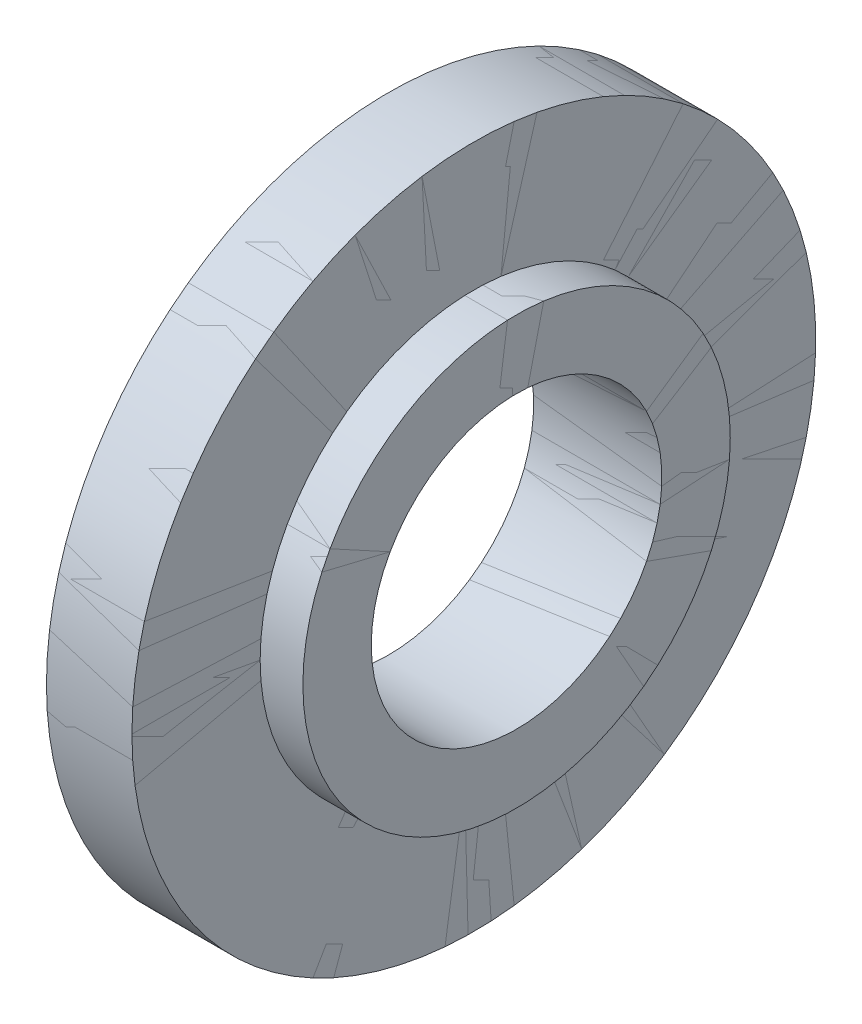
ISO-10303-21;
HEADER;
FILE_DESCRIPTION(('STEP AP214'),'2;1');
FILE_NAME('part.step','',(''),(''),'','','');
FILE_SCHEMA(('AUTOMOTIVE_DESIGN { 1 0 10303 214 1 1 1 1 }'));
ENDSEC;
DATA;
#1=APPLICATION_CONTEXT('core data for automotive mechanical design processes');
#2=APPLICATION_PROTOCOL_DEFINITION('international standard','automotive_design',2000,#1);
#3=PRODUCT_CONTEXT('',#1,'mechanical');
#4=PRODUCT('Part','Part','',(#3));
#5=PRODUCT_RELATED_PRODUCT_CATEGORY('part','',(#4));
#6=PRODUCT_DEFINITION_FORMATION('','',#4);
#7=PRODUCT_DEFINITION_CONTEXT('part definition',#1,'design');
#8=PRODUCT_DEFINITION('design','',#6,#7);
#9=PRODUCT_DEFINITION_SHAPE('','',#8);
#10=(LENGTH_UNIT() NAMED_UNIT(*) SI_UNIT(.MILLI.,.METRE.));
#11=(NAMED_UNIT(*) PLANE_ANGLE_UNIT() SI_UNIT($,.RADIAN.));
#12=(NAMED_UNIT(*) SI_UNIT($,.STERADIAN.) SOLID_ANGLE_UNIT());
#13=UNCERTAINTY_MEASURE_WITH_UNIT(LENGTH_MEASURE(1.E-05),#10,'distance_accuracy_value','');
#14=(GEOMETRIC_REPRESENTATION_CONTEXT(3) GLOBAL_UNCERTAINTY_ASSIGNED_CONTEXT((#13)) GLOBAL_UNIT_ASSIGNED_CONTEXT((#10,
#11,#12)) REPRESENTATION_CONTEXT('',''));
#15=CARTESIAN_POINT('',(0.,0.,0.));
#16=DIRECTION('',(0.,0.,1.));
#17=DIRECTION('',(1.,0.,0.));
#18=AXIS2_PLACEMENT_3D('',#15,#16,#17);
#19=CARTESIAN_POINT('',(1.5,0.,0.));
#20=DIRECTION('',(-1.,0.,0.));
#21=DIRECTION('',(0.,0.,1.));
#22=AXIS2_PLACEMENT_3D('',#19,#20,#21);
#23=CYLINDRICAL_SURFACE('',#22,2.50000000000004);
#24=CARTESIAN_POINT('',(1.5,0.,0.));
#25=DIRECTION('',(-1.,0.,0.));
#26=DIRECTION('',(0.,0.,1.));
#27=AXIS2_PLACEMENT_3D('',#24,#25,#26);
#28=CIRCLE('',#27,2.50000000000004);
#29=CARTESIAN_POINT('',(1.5,0.,2.50000000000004));
#30=VERTEX_POINT('',#29);
#31=EDGE_CURVE('P0_E375',#30,#30,#28,.F.);
#32=ORIENTED_EDGE('',*,*,#31,.F.);
#33=EDGE_LOOP('',(#32));
#34=FACE_BOUND('',#33,.T.);
#35=CARTESIAN_POINT('',(1.,0.,0.));
#36=DIRECTION('',(-1.,0.,0.));
#37=DIRECTION('',(0.,0.,1.));
#38=AXIS2_PLACEMENT_3D('',#35,#36,#37);
#39=CIRCLE('',#38,2.50000000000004);
#40=CARTESIAN_POINT('',(1.,0.,2.50000000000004));
#41=VERTEX_POINT('',#40);
#42=EDGE_CURVE('P0_E380',#41,#41,#39,.T.);
#43=ORIENTED_EDGE('',*,*,#42,.F.);
#44=EDGE_LOOP('',(#43));
#45=FACE_BOUND('',#44,.T.);
#46=ADVANCED_FACE('P0_F348',(#34,#45),#23,.T.);
#47=CARTESIAN_POINT('',(1.,-0.8849269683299,-5.5872089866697));
#48=DIRECTION('',(1.,0.,0.));
#49=DIRECTION('',(0.,0.809016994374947,0.587785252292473));
#50=AXIS2_PLACEMENT_3D('',#47,#48,#49);
#51=PLANE('',#50);
#52=ORIENTED_EDGE('',*,*,#42,.T.);
#53=EDGE_LOOP('',(#52));
#54=FACE_BOUND('',#53,.T.);
#55=CARTESIAN_POINT('',(1.,0.,0.));
#56=DIRECTION('',(-1.,0.,0.));
#57=DIRECTION('',(0.,0.,1.));
#58=AXIS2_PLACEMENT_3D('',#55,#56,#57);
#59=CIRCLE('',#58,4.00000000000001);
#60=CARTESIAN_POINT('',(1.,0.,4.00000000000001));
#61=VERTEX_POINT('',#60);
#62=EDGE_CURVE('P0_E370',#61,#61,#59,.F.);
#63=ORIENTED_EDGE('',*,*,#62,.T.);
#64=EDGE_LOOP('',(#63));
#65=FACE_BOUND('',#64,.T.);
#66=ADVANCED_FACE('P0_F385',(#54,#65),#51,.T.);
#67=CARTESIAN_POINT('',(1.5,-0.55307935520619,-3.4920056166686));
#68=DIRECTION('',(1.,0.,0.));
#69=DIRECTION('',(0.,0.809016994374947,0.587785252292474));
#70=AXIS2_PLACEMENT_3D('',#67,#68,#69);
#71=PLANE('',#70);
#72=CARTESIAN_POINT('',(1.5,0.,0.));
#73=DIRECTION('',(-1.,0.,0.));
#74=DIRECTION('',(0.,0.,1.));
#75=AXIS2_PLACEMENT_3D('',#72,#73,#74);
#76=CIRCLE('',#75,1.69999999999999);
#77=CARTESIAN_POINT('',(1.5,0.,1.69999999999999));
#78=VERTEX_POINT('',#77);
#79=EDGE_CURVE('P0_E361',#78,#78,#76,.F.);
#80=ORIENTED_EDGE('',*,*,#79,.F.);
#81=EDGE_LOOP('',(#80));
#82=FACE_BOUND('',#81,.T.);
#83=ORIENTED_EDGE('',*,*,#31,.T.);
#84=EDGE_LOOP('',(#83));
#85=FACE_BOUND('',#84,.T.);
#86=ADVANCED_FACE('P0_F394',(#82,#85),#71,.T.);
#87=CARTESIAN_POINT('',(1.,0.,0.));
#88=DIRECTION('',(-1.,0.,0.));
#89=DIRECTION('',(0.,0.,1.));
#90=AXIS2_PLACEMENT_3D('',#87,#88,#89);
#91=CYLINDRICAL_SURFACE('',#90,4.00000000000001);
#92=ORIENTED_EDGE('',*,*,#62,.F.);
#93=EDGE_LOOP('',(#92));
#94=FACE_BOUND('',#93,.T.);
#95=CARTESIAN_POINT('',(0.,0.,0.));
#96=DIRECTION('',(-1.,0.,0.));
#97=DIRECTION('',(0.,0.,1.));
#98=AXIS2_PLACEMENT_3D('',#95,#96,#97);
#99=CIRCLE('',#98,4.00000000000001);
#100=CARTESIAN_POINT('',(0.,0.,4.00000000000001));
#101=VERTEX_POINT('',#100);
#102=EDGE_CURVE('P0_E356',#101,#101,#99,.T.);
#103=ORIENTED_EDGE('',*,*,#102,.F.);
#104=EDGE_LOOP('',(#103));
#105=FACE_BOUND('',#104,.T.);
#106=ADVANCED_FACE('P0_F403',(#94,#105),#91,.T.);
#107=CARTESIAN_POINT('',(1.5,0.,0.));
#108=DIRECTION('',(-1.,0.,0.));
#109=DIRECTION('',(0.,0.,1.));
#110=AXIS2_PLACEMENT_3D('',#107,#108,#109);
#111=CYLINDRICAL_SURFACE('',#110,1.69999999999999);
#112=CARTESIAN_POINT('',(0.,0.,0.));
#113=DIRECTION('',(-1.,0.,0.));
#114=DIRECTION('',(0.,0.,1.));
#115=AXIS2_PLACEMENT_3D('',#112,#113,#114);
#116=CIRCLE('',#115,1.69999999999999);
#117=CARTESIAN_POINT('',(0.,0.,1.69999999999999));
#118=VERTEX_POINT('',#117);
#119=EDGE_CURVE('P0_E10',#118,#118,#116,.F.);
#120=ORIENTED_EDGE('',*,*,#119,.F.);
#121=EDGE_LOOP('',(#120));
#122=FACE_BOUND('',#121,.T.);
#123=ORIENTED_EDGE('',*,*,#79,.T.);
#124=EDGE_LOOP('',(#123));
#125=FACE_BOUND('',#124,.T.);
#126=ADVANCED_FACE('P0_F399',(#122,#125),#111,.F.);
#127=CARTESIAN_POINT('',(0.,-5.5872089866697,0.8849269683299));
#128=DIRECTION('',(-1.,0.,0.));
#129=DIRECTION('',(0.,0.809016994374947,0.587785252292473));
#130=AXIS2_PLACEMENT_3D('',#127,#128,#129);
#131=PLANE('',#130);
#132=ORIENTED_EDGE('',*,*,#119,.T.);
#133=EDGE_LOOP('',(#132));
#134=FACE_BOUND('',#133,.T.);
#135=ORIENTED_EDGE('',*,*,#102,.T.);
#136=EDGE_LOOP('',(#135));
#137=FACE_BOUND('',#136,.T.);
#138=ADVANCED_FACE('P0_F350',(#134,#137),#131,.T.);
#139=CLOSED_SHELL('',(#46,#66,#86,#106,#126,#138));
#140=MANIFOLD_SOLID_BREP('P0_B2',#139);
#141=CARTESIAN_POINT('',(1.5,0.,0.));
#142=DIRECTION('',(-1.,0.,0.));
#143=DIRECTION('',(0.,0.,1.));
#144=AXIS2_PLACEMENT_3D('',#141,#142,#143);
#145=CYLINDRICAL_SURFACE('',#144,2.50000000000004);
#146=CARTESIAN_POINT('',(1.5,0.,0.));
#147=DIRECTION('',(-1.,0.,0.));
#148=DIRECTION('',(0.,0.,1.));
#149=AXIS2_PLACEMENT_3D('',#146,#147,#148);
#150=CIRCLE('',#149,2.50000000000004);
#151=CARTESIAN_POINT('',(1.5,0.,2.50000000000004));
#152=VERTEX_POINT('',#151);
#153=EDGE_CURVE('P1_E41',#152,#152,#150,.F.);
#154=ORIENTED_EDGE('',*,*,#153,.F.);
#155=EDGE_LOOP('',(#154));
#156=FACE_BOUND('',#155,.T.);
#157=CARTESIAN_POINT('',(1.,0.,0.));
#158=DIRECTION('',(-1.,0.,0.));
#159=DIRECTION('',(0.,0.,1.));
#160=AXIS2_PLACEMENT_3D('',#157,#158,#159);
#161=CIRCLE('',#160,2.50000000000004);
#162=CARTESIAN_POINT('',(1.,0.,2.50000000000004));
#163=VERTEX_POINT('',#162);
#164=EDGE_CURVE('P1_E46',#163,#163,#161,.T.);
#165=ORIENTED_EDGE('',*,*,#164,.F.);
#166=EDGE_LOOP('',(#165));
#167=FACE_BOUND('',#166,.T.);
#168=ADVANCED_FACE('P1_F14',(#156,#167),#145,.T.);
#169=CARTESIAN_POINT('',(1.,-0.8849269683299,-5.5872089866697));
#170=DIRECTION('',(1.,0.,0.));
#171=DIRECTION('',(0.,0.809016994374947,0.587785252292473));
#172=AXIS2_PLACEMENT_3D('',#169,#170,#171);
#173=PLANE('',#172);
#174=ORIENTED_EDGE('',*,*,#164,.T.);
#175=EDGE_LOOP('',(#174));
#176=FACE_BOUND('',#175,.T.);
#177=CARTESIAN_POINT('',(1.,0.,0.));
#178=DIRECTION('',(-1.,0.,0.));
#179=DIRECTION('',(0.,0.,1.));
#180=AXIS2_PLACEMENT_3D('',#177,#178,#179);
#181=CIRCLE('',#180,4.00000000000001);
#182=CARTESIAN_POINT('',(1.,0.,4.00000000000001));
#183=VERTEX_POINT('',#182);
#184=EDGE_CURVE('P1_E36',#183,#183,#181,.F.);
#185=ORIENTED_EDGE('',*,*,#184,.T.);
#186=EDGE_LOOP('',(#185));
#187=FACE_BOUND('',#186,.T.);
#188=ADVANCED_FACE('P1_F51',(#176,#187),#173,.T.);
#189=CARTESIAN_POINT('',(1.5,-0.55307935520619,-3.4920056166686));
#190=DIRECTION('',(1.,0.,0.));
#191=DIRECTION('',(0.,0.809016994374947,0.587785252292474));
#192=AXIS2_PLACEMENT_3D('',#189,#190,#191);
#193=PLANE('',#192);
#194=CARTESIAN_POINT('',(1.5,0.,0.));
#195=DIRECTION('',(-1.,0.,0.));
#196=DIRECTION('',(0.,0.,1.));
#197=AXIS2_PLACEMENT_3D('',#194,#195,#196);
#198=CIRCLE('',#197,1.69999999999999);
#199=CARTESIAN_POINT('',(1.5,0.,1.69999999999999));
#200=VERTEX_POINT('',#199);
#201=EDGE_CURVE('P1_E27',#200,#200,#198,.F.);
#202=ORIENTED_EDGE('',*,*,#201,.F.);
#203=EDGE_LOOP('',(#202));
#204=FACE_BOUND('',#203,.T.);
#205=ORIENTED_EDGE('',*,*,#153,.T.);
#206=EDGE_LOOP('',(#205));
#207=FACE_BOUND('',#206,.T.);
#208=ADVANCED_FACE('P1_F56',(#204,#207),#193,.T.);
#209=CARTESIAN_POINT('',(1.,0.,0.));
#210=DIRECTION('',(-1.,0.,0.));
#211=DIRECTION('',(0.,0.,1.));
#212=AXIS2_PLACEMENT_3D('',#209,#210,#211);
#213=CYLINDRICAL_SURFACE('',#212,4.00000000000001);
#214=ORIENTED_EDGE('',*,*,#184,.F.);
#215=EDGE_LOOP('',(#214));
#216=FACE_BOUND('',#215,.T.);
#217=CARTESIAN_POINT('',(0.,0.,0.));
#218=DIRECTION('',(-1.,0.,0.));
#219=DIRECTION('',(0.,0.,1.));
#220=AXIS2_PLACEMENT_3D('',#217,#218,#219);
#221=CIRCLE('',#220,4.00000000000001);
#222=CARTESIAN_POINT('',(0.,0.,4.00000000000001));
#223=VERTEX_POINT('',#222);
#224=EDGE_CURVE('P1_E22',#223,#223,#221,.T.);
#225=ORIENTED_EDGE('',*,*,#224,.F.);
#226=EDGE_LOOP('',(#225));
#227=FACE_BOUND('',#226,.T.);
#228=ADVANCED_FACE('P1_F61',(#216,#227),#213,.T.);
#229=CARTESIAN_POINT('',(1.5,0.,0.));
#230=DIRECTION('',(-1.,0.,0.));
#231=DIRECTION('',(0.,0.,1.));
#232=AXIS2_PLACEMENT_3D('',#229,#230,#231);
#233=CYLINDRICAL_SURFACE('',#232,1.69999999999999);
#234=CARTESIAN_POINT('',(0.,0.,0.));
#235=DIRECTION('',(-1.,0.,0.));
#236=DIRECTION('',(0.,0.,1.));
#237=AXIS2_PLACEMENT_3D('',#234,#235,#236);
#238=CIRCLE('',#237,1.69999999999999);
#239=CARTESIAN_POINT('',(0.,0.,1.69999999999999));
#240=VERTEX_POINT('',#239);
#241=EDGE_CURVE('P1_E9',#240,#240,#238,.F.);
#242=ORIENTED_EDGE('',*,*,#241,.F.);
#243=EDGE_LOOP('',(#242));
#244=FACE_BOUND('',#243,.T.);
#245=ORIENTED_EDGE('',*,*,#201,.T.);
#246=EDGE_LOOP('',(#245));
#247=FACE_BOUND('',#246,.T.);
#248=ADVANCED_FACE('P1_F60',(#244,#247),#233,.F.);
#249=CARTESIAN_POINT('',(0.,-5.5872089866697,0.8849269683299));
#250=DIRECTION('',(-1.,0.,0.));
#251=DIRECTION('',(0.,0.809016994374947,0.587785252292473));
#252=AXIS2_PLACEMENT_3D('',#249,#250,#251);
#253=PLANE('',#252);
#254=ORIENTED_EDGE('',*,*,#241,.T.);
#255=EDGE_LOOP('',(#254));
#256=FACE_BOUND('',#255,.T.);
#257=ORIENTED_EDGE('',*,*,#224,.T.);
#258=EDGE_LOOP('',(#257));
#259=FACE_BOUND('',#258,.T.);
#260=ADVANCED_FACE('P1_F16',(#256,#259),#253,.T.);
#261=CLOSED_SHELL('',(#168,#188,#208,#228,#248,#260));
#262=MANIFOLD_SOLID_BREP('P1_B1',#261);
#263=ADVANCED_BREP_SHAPE_REPRESENTATION('',(#18,#140,#262),#14);
#264=SHAPE_DEFINITION_REPRESENTATION(#9,#263);
ENDSEC;
END-ISO-10303-21;
